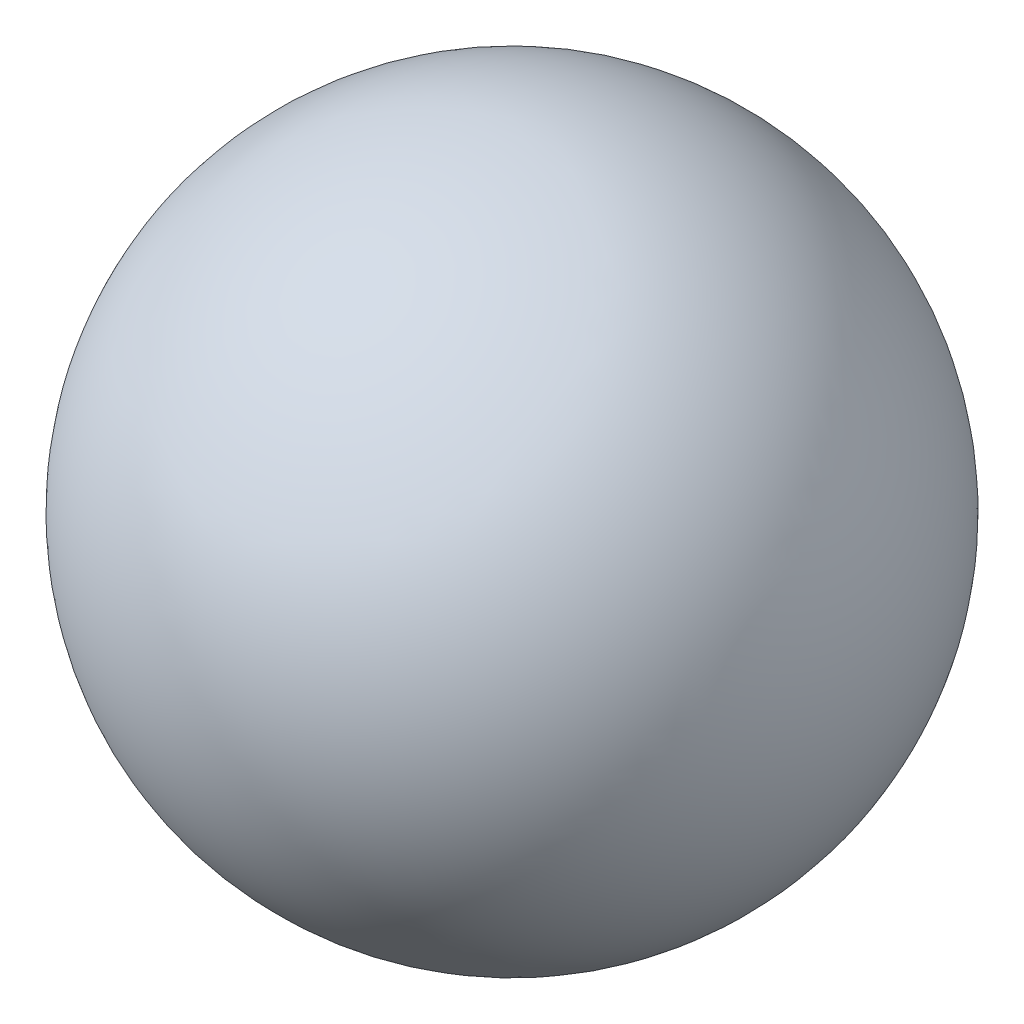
ISO-10303-21;
HEADER;
FILE_DESCRIPTION(('STEP AP214'),'2;1');
FILE_NAME('part.step','',(''),(''),'','','');
FILE_SCHEMA(('AUTOMOTIVE_DESIGN { 1 0 10303 214 1 1 1 1 }'));
ENDSEC;
DATA;
#1=APPLICATION_CONTEXT('core data for automotive mechanical design processes');
#2=APPLICATION_PROTOCOL_DEFINITION('international standard','automotive_design',2000,#1);
#3=PRODUCT_CONTEXT('',#1,'mechanical');
#4=PRODUCT('Part','Part','',(#3));
#5=PRODUCT_RELATED_PRODUCT_CATEGORY('part','',(#4));
#6=PRODUCT_DEFINITION_FORMATION('','',#4);
#7=PRODUCT_DEFINITION_CONTEXT('part definition',#1,'design');
#8=PRODUCT_DEFINITION('design','',#6,#7);
#9=PRODUCT_DEFINITION_SHAPE('','',#8);
#10=(LENGTH_UNIT() NAMED_UNIT(*) SI_UNIT(.MILLI.,.METRE.));
#11=(NAMED_UNIT(*) PLANE_ANGLE_UNIT() SI_UNIT($,.RADIAN.));
#12=(NAMED_UNIT(*) SI_UNIT($,.STERADIAN.) SOLID_ANGLE_UNIT());
#13=UNCERTAINTY_MEASURE_WITH_UNIT(LENGTH_MEASURE(1.E-05),#10,'distance_accuracy_value','');
#14=(GEOMETRIC_REPRESENTATION_CONTEXT(3) GLOBAL_UNCERTAINTY_ASSIGNED_CONTEXT((#13)) GLOBAL_UNIT_ASSIGNED_CONTEXT((#10,
#11,#12)) REPRESENTATION_CONTEXT('',''));
#15=CARTESIAN_POINT('',(0.,0.,0.));
#16=DIRECTION('',(0.,0.,1.));
#17=DIRECTION('',(1.,0.,0.));
#18=AXIS2_PLACEMENT_3D('',#15,#16,#17);
#19=CARTESIAN_POINT('',(1.35,0.,-1.35));
#20=DIRECTION('',(-1.,0.,0.));
#21=DIRECTION('',(0.,0.,-1.));
#22=AXIS2_PLACEMENT_3D('',#19,#20,#21);
#23=SPHERICAL_SURFACE('',#22,0.9);
#24=CARTESIAN_POINT('',(0.449999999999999,0.,-1.35));
#25=VERTEX_POINT('',#24);
#26=VERTEX_LOOP('',#25);
#27=FACE_BOUND('',#26,.T.);
#28=ADVANCED_FACE('F348',(#27),#23,.T.);
#29=CLOSED_SHELL('',(#28));
#30=MANIFOLD_SOLID_BREP('B2',#29);
#31=ADVANCED_BREP_SHAPE_REPRESENTATION('',(#18,#30),#14);
#32=SHAPE_DEFINITION_REPRESENTATION(#9,#31);
ENDSEC;
END-ISO-10303-21;
